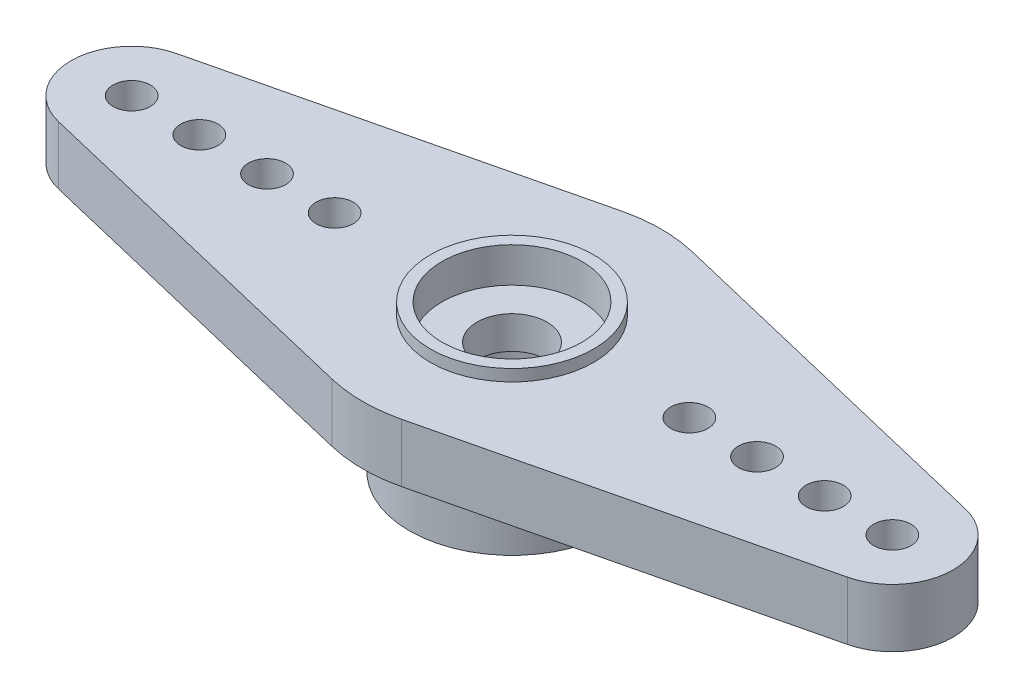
from build123d import *

# Parameters (mm, degrees)
ESQUISSE1_R             = 1.5
ESQUISSE1_R_2           = 0.8
BOSS_EXTRU_1_DEPTH      = 2.5
ESQUISSE7_R             = 4.4
BOSS_EXTRU_3_DEPTH      = 3.3
ESQUISSE10_R            = 3
ENL_V_MAT_EXTRU_6_DEPTH = 3.4
ESQUISSE12_R            = 3.5
ESQUISSE12_R_2          = 3
BOSS_EXTRU_5_DEPTH      = 0.5
ENL_V_START             = -1
ESQUISSE13_R            = 3
ESQUISSE13_R_2          = 1.5
ENL_V_MAT_EXTRU_7_DEPTH = 1


with BuildPart() as part:
    # Esquisse1 → Boss.-Extru.1 (new body)
    with BuildSketch(Plane(origin=(0, 0, 0), x_dir=(1, 0, 0), z_dir=(0, 1, 0))):
        with BuildLine():
            Line((16.906134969, 2.528359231), (1.49202454, 6.223653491))
            ThreePointArc((1.49202454, 6.223653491), (0, 6.4), (-1.49202454, 6.223653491))
            Line((-1.49202454, 6.223653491), (-16.906134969, 2.528359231))
            ThreePointArc((-16.906134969, 2.528359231), (-18.9, 0), (-16.906134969, -2.528359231))
            Line((-16.906134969, -2.528359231), (-1.49202454, -6.223653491))
            ThreePointArc((-1.49202454, -6.223653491), (0, -6.4), (1.49202454, -6.223653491))
            Line((1.49202454, -6.223653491), (16.906134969, -2.528359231))
            ThreePointArc((16.906134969, -2.528359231), (18.9, 0), (16.906134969, 2.528359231))
        make_face()
        with Locations(Location((0, 0, 0), (0, 0, 270))):
            Circle(ESQUISSE1_R, mode=Mode.SUBTRACT)
        with Locations(Location((16.3, 0, 0), (0, 0, 270))):
            Circle(ESQUISSE1_R_2, mode=Mode.SUBTRACT)
        with Locations(Location((13.4, 0, 0), (0, 0, 270))):
            Circle(ESQUISSE1_R_2, mode=Mode.SUBTRACT)
        with Locations(Location((10.5, 0, 0), (0, 0, 270))):
            Circle(ESQUISSE1_R_2, mode=Mode.SUBTRACT)
        with Locations(Location((-16.3, 0, 0), (0, 0, 270))):
            Circle(ESQUISSE1_R_2, mode=Mode.SUBTRACT)
        with Locations(Location((-13.4, 0, 0), (0, 0, 270))):
            Circle(ESQUISSE1_R_2, mode=Mode.SUBTRACT)
        with Locations(Location((-10.5, 0, 0), (0, 0, 270))):
            Circle(ESQUISSE1_R_2, mode=Mode.SUBTRACT)
        with Locations(Location((7.6, 0, 0), (0, 0, 270))):
            Circle(ESQUISSE1_R_2, mode=Mode.SUBTRACT)
        with Locations(Location((-7.6, 0, 0), (0, 0, 270))):
            Circle(ESQUISSE1_R_2, mode=Mode.SUBTRACT)
    extrude(amount=BOSS_EXTRU_1_DEPTH)

    # Esquisse7 → Boss.-Extru.3 (add)
    with BuildSketch(Plane.XZ):
        with Locations(Location((0, 0, 0), (0, 0, 90))):
            Circle(ESQUISSE7_R)
    extrude(amount=BOSS_EXTRU_3_DEPTH)

    # Esquisse10 → Enl_v. mat.-Extru.6 (cut)
    with BuildSketch(Plane.XZ.offset(3.3)):
        with Locations(Location((0, 0, 0), (0, 0, 270))):
            Circle(ESQUISSE10_R)
    extrude(amount=-ENL_V_MAT_EXTRU_6_DEPTH, mode=Mode.SUBTRACT)

    # Esquisse12 → Boss.-Extru.5 (add)
    with BuildSketch(Plane(origin=(0, 2.5, 0), x_dir=(1, 0, 0), z_dir=(0, 1, 0))):
        with Locations(Location((0, 0, 0), (0, 0, 270))):
            Circle(ESQUISSE12_R)
        with Locations(Location((0, 0, 0), (0, 0, 90))):
            Circle(ESQUISSE12_R_2, mode=Mode.SUBTRACT)
    extrude(amount=BOSS_EXTRU_5_DEPTH)

    # Esquisse13 → Enl_v. mat.-Extru.7 (cut)
    with BuildSketch(Plane(origin=(0, 2.5, 0), x_dir=(1, 0, 0), z_dir=(0, 1, 0)).offset(ENL_V_START)):
        with Locations(Location((0, 0, 0), (0, 0, 90))):
            Circle(ESQUISSE13_R)
        with Locations(Location((0, 0, 0), (0, 0, 90))):
            Circle(ESQUISSE13_R_2, mode=Mode.SUBTRACT)
    extrude(amount=ENL_V_MAT_EXTRU_7_DEPTH, mode=Mode.SUBTRACT)


solid = part.part
